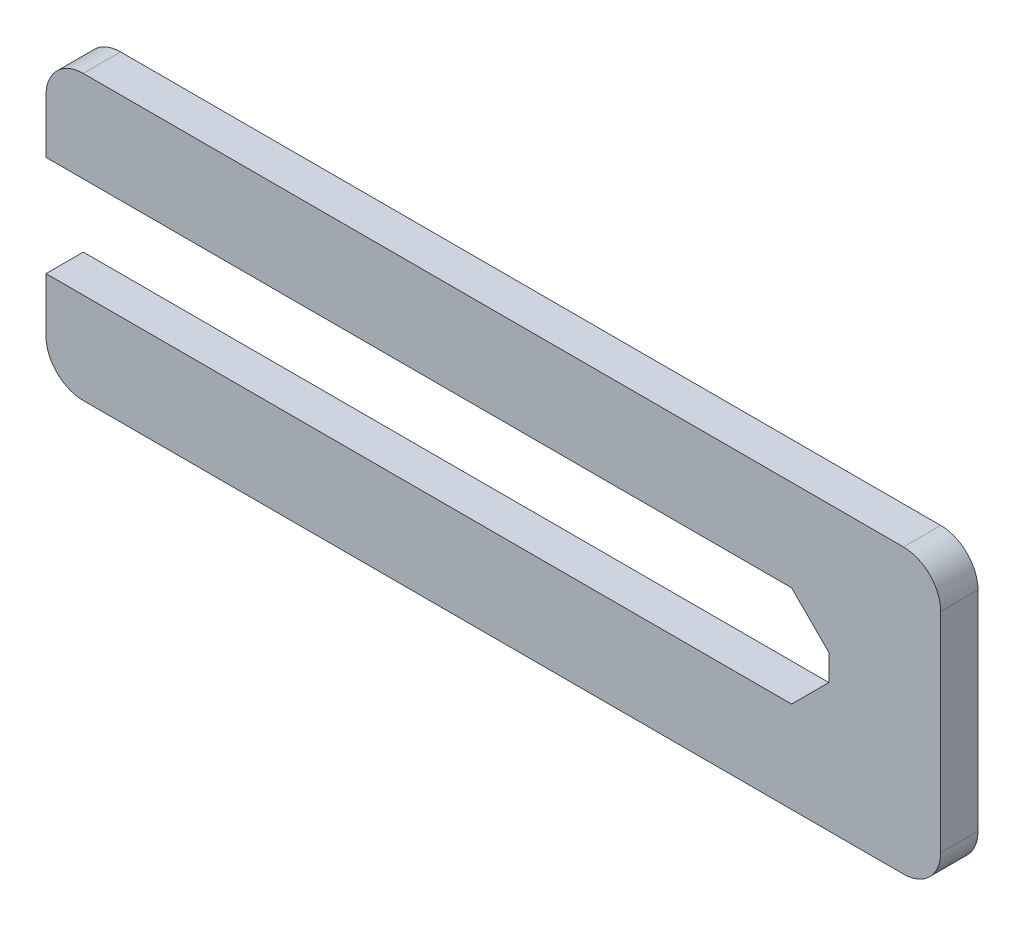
ISO-10303-21;
HEADER;
FILE_DESCRIPTION(('STEP AP214'),'2;1');
FILE_NAME('part.step','',(''),(''),'','','');
FILE_SCHEMA(('AUTOMOTIVE_DESIGN { 1 0 10303 214 1 1 1 1 }'));
ENDSEC;
DATA;
#1=APPLICATION_CONTEXT('core data for automotive mechanical design processes');
#2=APPLICATION_PROTOCOL_DEFINITION('international standard','automotive_design',2000,#1);
#3=PRODUCT_CONTEXT('',#1,'mechanical');
#4=PRODUCT('Part','Part','',(#3));
#5=PRODUCT_RELATED_PRODUCT_CATEGORY('part','',(#4));
#6=PRODUCT_DEFINITION_FORMATION('','',#4);
#7=PRODUCT_DEFINITION_CONTEXT('part definition',#1,'design');
#8=PRODUCT_DEFINITION('design','',#6,#7);
#9=PRODUCT_DEFINITION_SHAPE('','',#8);
#10=(LENGTH_UNIT() NAMED_UNIT(*) SI_UNIT(.MILLI.,.METRE.));
#11=(NAMED_UNIT(*) PLANE_ANGLE_UNIT() SI_UNIT($,.RADIAN.));
#12=(NAMED_UNIT(*) SI_UNIT($,.STERADIAN.) SOLID_ANGLE_UNIT());
#13=UNCERTAINTY_MEASURE_WITH_UNIT(LENGTH_MEASURE(1.E-05),#10,'distance_accuracy_value','');
#14=(GEOMETRIC_REPRESENTATION_CONTEXT(3) GLOBAL_UNCERTAINTY_ASSIGNED_CONTEXT((#13)) GLOBAL_UNIT_ASSIGNED_CONTEXT((#10,
#11,#12)) REPRESENTATION_CONTEXT('',''));
#15=CARTESIAN_POINT('',(0.,0.,0.));
#16=DIRECTION('',(0.,0.,1.));
#17=DIRECTION('',(1.,0.,0.));
#18=AXIS2_PLACEMENT_3D('',#15,#16,#17);
#19=CARTESIAN_POINT('',(0.,0.,5.));
#20=DIRECTION('',(1.,0.,0.));
#21=DIRECTION('',(0.,0.,-1.));
#22=AXIS2_PLACEMENT_3D('',#19,#20,#21);
#23=PLANE('',#22);
#24=DIRECTION('',(0.,-1.,0.));
#25=VECTOR('',#24,1.);
#26=CARTESIAN_POINT('',(0.,0.,5.));
#27=LINE('',#26,#25);
#28=CARTESIAN_POINT('',(0.,33.,5.));
#29=VERTEX_POINT('',#28);
#30=CARTESIAN_POINT('',(0.,25.75,5.));
#31=VERTEX_POINT('',#30);
#32=EDGE_CURVE('E159',#29,#31,#27,.T.);
#33=ORIENTED_EDGE('',*,*,#32,.F.);
#34=DIRECTION('',(0.,0.,-1.));
#35=VECTOR('',#34,1.);
#36=CARTESIAN_POINT('',(0.,33.,5.));
#37=LINE('',#36,#35);
#38=CARTESIAN_POINT('',(0.,33.,0.));
#39=VERTEX_POINT('',#38);
#40=EDGE_CURVE('E230',#29,#39,#37,.T.);
#41=ORIENTED_EDGE('',*,*,#40,.T.);
#42=DIRECTION('',(0.,-1.,0.));
#43=VECTOR('',#42,1.);
#44=CARTESIAN_POINT('',(0.,0.,0.));
#45=LINE('',#44,#43);
#46=CARTESIAN_POINT('',(0.,25.75,0.));
#47=VERTEX_POINT('',#46);
#48=EDGE_CURVE('E172',#39,#47,#45,.T.);
#49=ORIENTED_EDGE('',*,*,#48,.T.);
#50=DIRECTION('',(0.,0.,1.));
#51=VECTOR('',#50,1.);
#52=CARTESIAN_POINT('',(0.,25.75,-1.));
#53=LINE('',#52,#51);
#54=EDGE_CURVE('E144',#47,#31,#53,.T.);
#55=ORIENTED_EDGE('',*,*,#54,.T.);
#56=EDGE_LOOP('',(#33,#41,#49,#55));
#57=FACE_BOUND('',#56,.T.);
#58=ADVANCED_FACE('F32',(#57),#23,.F.);
#59=CARTESIAN_POINT('',(0.,12.25,0.));
#60=VERTEX_POINT('',#59);
#61=CARTESIAN_POINT('',(0.,5.,0.));
#62=VERTEX_POINT('',#61);
#63=EDGE_CURVE('E175',#60,#62,#45,.T.);
#64=ORIENTED_EDGE('',*,*,#63,.T.);
#65=DIRECTION('',(0.,0.,-1.));
#66=VECTOR('',#65,1.);
#67=CARTESIAN_POINT('',(0.,5.,5.));
#68=LINE('',#67,#66);
#69=CARTESIAN_POINT('',(0.,5.,5.));
#70=VERTEX_POINT('',#69);
#71=EDGE_CURVE('E158',#62,#70,#68,.F.);
#72=ORIENTED_EDGE('',*,*,#71,.T.);
#73=CARTESIAN_POINT('',(0.,12.25,5.));
#74=VERTEX_POINT('',#73);
#75=EDGE_CURVE('E150',#74,#70,#27,.T.);
#76=ORIENTED_EDGE('',*,*,#75,.F.);
#77=DIRECTION('',(0.,0.,1.));
#78=VECTOR('',#77,1.);
#79=CARTESIAN_POINT('',(0.,12.25,-1.));
#80=LINE('',#79,#78);
#81=EDGE_CURVE('E133',#60,#74,#80,.T.);
#82=ORIENTED_EDGE('',*,*,#81,.F.);
#83=EDGE_LOOP('',(#64,#72,#76,#82));
#84=FACE_BOUND('',#83,.T.);
#85=ADVANCED_FACE('F156',(#84),#23,.F.);
#86=CARTESIAN_POINT('',(0.,0.,5.));
#87=DIRECTION('',(0.,1.,0.));
#88=DIRECTION('',(0.,0.,1.));
#89=AXIS2_PLACEMENT_3D('',#86,#87,#88);
#90=PLANE('',#89);
#91=DIRECTION('',(1.,0.,0.));
#92=VECTOR('',#91,1.);
#93=CARTESIAN_POINT('',(0.,0.,0.));
#94=LINE('',#93,#92);
#95=CARTESIAN_POINT('',(5.,0.,0.));
#96=VERTEX_POINT('',#95);
#97=CARTESIAN_POINT('',(115.,0.,0.));
#98=VERTEX_POINT('',#97);
#99=EDGE_CURVE('E174',#96,#98,#94,.T.);
#100=ORIENTED_EDGE('',*,*,#99,.T.);
#101=DIRECTION('',(0.,0.,-1.));
#102=VECTOR('',#101,1.);
#103=CARTESIAN_POINT('',(115.,0.,5.));
#104=LINE('',#103,#102);
#105=CARTESIAN_POINT('',(115.,0.,5.));
#106=VERTEX_POINT('',#105);
#107=EDGE_CURVE('E220',#98,#106,#104,.F.);
#108=ORIENTED_EDGE('',*,*,#107,.T.);
#109=DIRECTION('',(1.,0.,0.));
#110=VECTOR('',#109,1.);
#111=CARTESIAN_POINT('',(0.,0.,5.));
#112=LINE('',#111,#110);
#113=CARTESIAN_POINT('',(5.,0.,5.));
#114=VERTEX_POINT('',#113);
#115=EDGE_CURVE('E162',#114,#106,#112,.T.);
#116=ORIENTED_EDGE('',*,*,#115,.F.);
#117=DIRECTION('',(0.,0.,-1.));
#118=VECTOR('',#117,1.);
#119=CARTESIAN_POINT('',(5.,0.,5.));
#120=LINE('',#119,#118);
#121=EDGE_CURVE('E217',#114,#96,#120,.T.);
#122=ORIENTED_EDGE('',*,*,#121,.T.);
#123=EDGE_LOOP('',(#100,#108,#116,#122));
#124=FACE_BOUND('',#123,.T.);
#125=ADVANCED_FACE('F264',(#124),#90,.F.);
#126=CARTESIAN_POINT('',(120.,0.,5.));
#127=DIRECTION('',(-1.,0.,0.));
#128=DIRECTION('',(0.,0.,1.));
#129=AXIS2_PLACEMENT_3D('',#126,#127,#128);
#130=PLANE('',#129);
#131=DIRECTION('',(0.,1.,0.));
#132=VECTOR('',#131,1.);
#133=CARTESIAN_POINT('',(120.,0.,5.));
#134=LINE('',#133,#132);
#135=CARTESIAN_POINT('',(120.,5.,5.));
#136=VERTEX_POINT('',#135);
#137=CARTESIAN_POINT('',(120.,33.,5.));
#138=VERTEX_POINT('',#137);
#139=EDGE_CURVE('E168',#136,#138,#134,.T.);
#140=ORIENTED_EDGE('',*,*,#139,.F.);
#141=DIRECTION('',(0.,0.,-1.));
#142=VECTOR('',#141,1.);
#143=CARTESIAN_POINT('',(120.,5.,5.));
#144=LINE('',#143,#142);
#145=CARTESIAN_POINT('',(120.,5.,0.));
#146=VERTEX_POINT('',#145);
#147=EDGE_CURVE('E206',#136,#146,#144,.T.);
#148=ORIENTED_EDGE('',*,*,#147,.T.);
#149=DIRECTION('',(0.,1.,0.));
#150=VECTOR('',#149,1.);
#151=CARTESIAN_POINT('',(120.,0.,0.));
#152=LINE('',#151,#150);
#153=CARTESIAN_POINT('',(120.,33.,0.));
#154=VERTEX_POINT('',#153);
#155=EDGE_CURVE('E163',#146,#154,#152,.T.);
#156=ORIENTED_EDGE('',*,*,#155,.T.);
#157=DIRECTION('',(0.,0.,-1.));
#158=VECTOR('',#157,1.);
#159=CARTESIAN_POINT('',(120.,33.,5.));
#160=LINE('',#159,#158);
#161=EDGE_CURVE('E204',#154,#138,#160,.F.);
#162=ORIENTED_EDGE('',*,*,#161,.T.);
#163=EDGE_LOOP('',(#140,#148,#156,#162));
#164=FACE_BOUND('',#163,.T.);
#165=ADVANCED_FACE('F272',(#164),#130,.F.);
#166=CARTESIAN_POINT('',(0.,38.,5.));
#167=DIRECTION('',(0.,-1.,0.));
#168=DIRECTION('',(0.,0.,-1.));
#169=AXIS2_PLACEMENT_3D('',#166,#167,#168);
#170=PLANE('',#169);
#171=DIRECTION('',(-1.,0.,0.));
#172=VECTOR('',#171,1.);
#173=CARTESIAN_POINT('',(0.,38.,0.));
#174=LINE('',#173,#172);
#175=CARTESIAN_POINT('',(115.,38.,0.));
#176=VERTEX_POINT('',#175);
#177=CARTESIAN_POINT('',(5.,38.,0.));
#178=VERTEX_POINT('',#177);
#179=EDGE_CURVE('E160',#176,#178,#174,.T.);
#180=ORIENTED_EDGE('',*,*,#179,.T.);
#181=DIRECTION('',(0.,0.,-1.));
#182=VECTOR('',#181,1.);
#183=CARTESIAN_POINT('',(5.,38.,5.));
#184=LINE('',#183,#182);
#185=CARTESIAN_POINT('',(5.,38.,5.));
#186=VERTEX_POINT('',#185);
#187=EDGE_CURVE('E11',#178,#186,#184,.F.);
#188=ORIENTED_EDGE('',*,*,#187,.T.);
#189=DIRECTION('',(-1.,0.,0.));
#190=VECTOR('',#189,1.);
#191=CARTESIAN_POINT('',(0.,38.,5.));
#192=LINE('',#191,#190);
#193=CARTESIAN_POINT('',(115.,38.,5.));
#194=VERTEX_POINT('',#193);
#195=EDGE_CURVE('E170',#194,#186,#192,.T.);
#196=ORIENTED_EDGE('',*,*,#195,.F.);
#197=DIRECTION('',(0.,0.,-1.));
#198=VECTOR('',#197,1.);
#199=CARTESIAN_POINT('',(115.,38.,5.));
#200=LINE('',#199,#198);
#201=EDGE_CURVE('E40',#194,#176,#200,.T.);
#202=ORIENTED_EDGE('',*,*,#201,.T.);
#203=EDGE_LOOP('',(#180,#188,#196,#202));
#204=FACE_BOUND('',#203,.T.);
#205=ADVANCED_FACE('F235',(#204),#170,.F.);
#206=CARTESIAN_POINT('',(0.,38.,5.));
#207=DIRECTION('',(0.,0.,-1.));
#208=DIRECTION('',(-1.,0.,0.));
#209=AXIS2_PLACEMENT_3D('',#206,#207,#208);
#210=PLANE('',#209);
#211=ORIENTED_EDGE('',*,*,#115,.T.);
#212=CARTESIAN_POINT('',(115.,5.,5.));
#213=DIRECTION('',(0.,0.,-1.));
#214=DIRECTION('',(-1.,0.,0.));
#215=AXIS2_PLACEMENT_3D('',#212,#213,#214);
#216=CIRCLE('',#215,5.);
#217=EDGE_CURVE('E227',#106,#136,#216,.F.);
#218=ORIENTED_EDGE('',*,*,#217,.T.);
#219=ORIENTED_EDGE('',*,*,#139,.T.);
#220=CARTESIAN_POINT('',(115.,33.,5.));
#221=DIRECTION('',(0.,0.,-1.));
#222=DIRECTION('',(-1.,0.,0.));
#223=AXIS2_PLACEMENT_3D('',#220,#221,#222);
#224=CIRCLE('',#223,5.);
#225=EDGE_CURVE('E52',#138,#194,#224,.F.);
#226=ORIENTED_EDGE('',*,*,#225,.T.);
#227=ORIENTED_EDGE('',*,*,#195,.T.);
#228=CARTESIAN_POINT('',(5.,33.,5.));
#229=DIRECTION('',(0.,0.,-1.));
#230=DIRECTION('',(-1.,0.,0.));
#231=AXIS2_PLACEMENT_3D('',#228,#229,#230);
#232=CIRCLE('',#231,5.);
#233=EDGE_CURVE('E223',#186,#29,#232,.F.);
#234=ORIENTED_EDGE('',*,*,#233,.T.);
#235=ORIENTED_EDGE('',*,*,#32,.T.);
#236=DIRECTION('',(-1.,0.,0.));
#237=VECTOR('',#236,1.);
#238=CARTESIAN_POINT('',(0.,25.75,5.));
#239=LINE('',#238,#237);
#240=CARTESIAN_POINT('',(100.,25.75,5.));
#241=VERTEX_POINT('',#240);
#242=EDGE_CURVE('E145',#241,#31,#239,.T.);
#243=ORIENTED_EDGE('',*,*,#242,.F.);
#244=DIRECTION('',(-0.707106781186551,0.707106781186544,0.));
#245=VECTOR('',#244,1.);
#246=CARTESIAN_POINT('',(43.8749999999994,81.8749999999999,5.));
#247=LINE('',#246,#245);
#248=CARTESIAN_POINT('',(105.,20.75,5.));
#249=VERTEX_POINT('',#248);
#250=EDGE_CURVE('E197',#241,#249,#247,.F.);
#251=ORIENTED_EDGE('',*,*,#250,.T.);
#252=DIRECTION('',(0.,1.,0.));
#253=VECTOR('',#252,1.);
#254=CARTESIAN_POINT('',(105.,25.75,5.));
#255=LINE('',#254,#253);
#256=CARTESIAN_POINT('',(105.,17.25,5.));
#257=VERTEX_POINT('',#256);
#258=EDGE_CURVE('E154',#257,#249,#255,.T.);
#259=ORIENTED_EDGE('',*,*,#258,.F.);
#260=DIRECTION('',(0.707106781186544,0.707106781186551,0.));
#261=VECTOR('',#260,1.);
#262=CARTESIAN_POINT('',(62.8750000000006,-24.8749999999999,5.));
#263=LINE('',#262,#261);
#264=CARTESIAN_POINT('',(100.,12.25,5.));
#265=VERTEX_POINT('',#264);
#266=EDGE_CURVE('E153',#257,#265,#263,.F.);
#267=ORIENTED_EDGE('',*,*,#266,.T.);
#268=DIRECTION('',(1.,0.,0.));
#269=VECTOR('',#268,1.);
#270=CARTESIAN_POINT('',(0.,12.25,5.));
#271=LINE('',#270,#269);
#272=EDGE_CURVE('E136',#74,#265,#271,.T.);
#273=ORIENTED_EDGE('',*,*,#272,.F.);
#274=ORIENTED_EDGE('',*,*,#75,.T.);
#275=CARTESIAN_POINT('',(5.,5.,5.));
#276=DIRECTION('',(0.,0.,-1.));
#277=DIRECTION('',(-1.,0.,0.));
#278=AXIS2_PLACEMENT_3D('',#275,#276,#277);
#279=CIRCLE('',#278,5.);
#280=EDGE_CURVE('E225',#70,#114,#279,.F.);
#281=ORIENTED_EDGE('',*,*,#280,.T.);
#282=EDGE_LOOP('',(#211,#218,#219,#226,#227,#234,#235,#243,#251,#259,#267,#273,#274,#281));
#283=FACE_BOUND('',#282,.T.);
#284=ADVANCED_FACE('F149',(#283),#210,.F.);
#285=CARTESIAN_POINT('',(0.,38.,0.));
#286=DIRECTION('',(0.,0.,-1.));
#287=DIRECTION('',(-1.,0.,0.));
#288=AXIS2_PLACEMENT_3D('',#285,#286,#287);
#289=PLANE('',#288);
#290=ORIENTED_EDGE('',*,*,#155,.F.);
#291=CARTESIAN_POINT('',(115.,5.,0.));
#292=DIRECTION('',(0.,0.,-1.));
#293=DIRECTION('',(-1.,0.,0.));
#294=AXIS2_PLACEMENT_3D('',#291,#292,#293);
#295=CIRCLE('',#294,5.);
#296=EDGE_CURVE('E215',#146,#98,#295,.T.);
#297=ORIENTED_EDGE('',*,*,#296,.T.);
#298=ORIENTED_EDGE('',*,*,#99,.F.);
#299=CARTESIAN_POINT('',(5.,5.,0.));
#300=DIRECTION('',(0.,0.,-1.));
#301=DIRECTION('',(-1.,0.,0.));
#302=AXIS2_PLACEMENT_3D('',#299,#300,#301);
#303=CIRCLE('',#302,5.);
#304=EDGE_CURVE('E213',#96,#62,#303,.T.);
#305=ORIENTED_EDGE('',*,*,#304,.T.);
#306=ORIENTED_EDGE('',*,*,#63,.F.);
#307=DIRECTION('',(-1.,0.,0.));
#308=VECTOR('',#307,1.);
#309=CARTESIAN_POINT('',(0.,12.25,0.));
#310=LINE('',#309,#308);
#311=CARTESIAN_POINT('',(100.,12.25,0.));
#312=VERTEX_POINT('',#311);
#313=EDGE_CURVE('E139',#312,#60,#310,.T.);
#314=ORIENTED_EDGE('',*,*,#313,.F.);
#315=DIRECTION('',(-0.707106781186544,-0.707106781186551,0.));
#316=VECTOR('',#315,1.);
#317=CARTESIAN_POINT('',(105.,17.25,0.));
#318=LINE('',#317,#316);
#319=CARTESIAN_POINT('',(105.,17.25,0.));
#320=VERTEX_POINT('',#319);
#321=EDGE_CURVE('E202',#312,#320,#318,.F.);
#322=ORIENTED_EDGE('',*,*,#321,.T.);
#323=DIRECTION('',(0.,-1.,0.));
#324=VECTOR('',#323,1.);
#325=CARTESIAN_POINT('',(105.,38.,0.));
#326=LINE('',#325,#324);
#327=CARTESIAN_POINT('',(105.,20.75,0.));
#328=VERTEX_POINT('',#327);
#329=EDGE_CURVE('E181',#328,#320,#326,.T.);
#330=ORIENTED_EDGE('',*,*,#329,.F.);
#331=DIRECTION('',(0.707106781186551,-0.707106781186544,0.));
#332=VECTOR('',#331,1.);
#333=CARTESIAN_POINT('',(100.,25.75,0.));
#334=LINE('',#333,#332);
#335=CARTESIAN_POINT('',(100.,25.75,0.));
#336=VERTEX_POINT('',#335);
#337=EDGE_CURVE('E199',#328,#336,#334,.F.);
#338=ORIENTED_EDGE('',*,*,#337,.T.);
#339=DIRECTION('',(1.,0.,0.));
#340=VECTOR('',#339,1.);
#341=CARTESIAN_POINT('',(0.,25.75,0.));
#342=LINE('',#341,#340);
#343=EDGE_CURVE('E184',#47,#336,#342,.T.);
#344=ORIENTED_EDGE('',*,*,#343,.F.);
#345=ORIENTED_EDGE('',*,*,#48,.F.);
#346=CARTESIAN_POINT('',(5.,33.,0.));
#347=DIRECTION('',(0.,0.,-1.));
#348=DIRECTION('',(-1.,0.,0.));
#349=AXIS2_PLACEMENT_3D('',#346,#347,#348);
#350=CIRCLE('',#349,5.);
#351=EDGE_CURVE('E211',#39,#178,#350,.T.);
#352=ORIENTED_EDGE('',*,*,#351,.T.);
#353=ORIENTED_EDGE('',*,*,#179,.F.);
#354=CARTESIAN_POINT('',(115.,33.,0.));
#355=DIRECTION('',(0.,0.,-1.));
#356=DIRECTION('',(-1.,0.,0.));
#357=AXIS2_PLACEMENT_3D('',#354,#355,#356);
#358=CIRCLE('',#357,5.);
#359=EDGE_CURVE('E209',#176,#154,#358,.T.);
#360=ORIENTED_EDGE('',*,*,#359,.T.);
#361=EDGE_LOOP('',(#290,#297,#298,#305,#306,#314,#322,#330,#338,#344,#345,#352,#353,#360));
#362=FACE_BOUND('',#361,.T.);
#363=ADVANCED_FACE('F239',(#362),#289,.T.);
#364=CARTESIAN_POINT('',(0.,25.75,-1.));
#365=DIRECTION('',(0.,1.,0.));
#366=DIRECTION('',(0.,0.,1.));
#367=AXIS2_PLACEMENT_3D('',#364,#365,#366);
#368=PLANE('',#367);
#369=ORIENTED_EDGE('',*,*,#343,.T.);
#370=DIRECTION('',(0.,0.,1.));
#371=VECTOR('',#370,1.);
#372=CARTESIAN_POINT('',(100.,25.75,5.));
#373=LINE('',#372,#371);
#374=EDGE_CURVE('E187',#336,#241,#373,.T.);
#375=ORIENTED_EDGE('',*,*,#374,.T.);
#376=ORIENTED_EDGE('',*,*,#242,.T.);
#377=ORIENTED_EDGE('',*,*,#54,.F.);
#378=EDGE_LOOP('',(#369,#375,#376,#377));
#379=FACE_BOUND('',#378,.T.);
#380=ADVANCED_FACE('F253',(#379),#368,.F.);
#381=CARTESIAN_POINT('',(105.,25.75,-1.));
#382=DIRECTION('',(1.,0.,0.));
#383=DIRECTION('',(0.,0.,-1.));
#384=AXIS2_PLACEMENT_3D('',#381,#382,#383);
#385=PLANE('',#384);
#386=ORIENTED_EDGE('',*,*,#258,.T.);
#387=DIRECTION('',(0.,0.,-1.));
#388=VECTOR('',#387,1.);
#389=CARTESIAN_POINT('',(105.,20.75,0.));
#390=LINE('',#389,#388);
#391=EDGE_CURVE('E193',#249,#328,#390,.T.);
#392=ORIENTED_EDGE('',*,*,#391,.T.);
#393=ORIENTED_EDGE('',*,*,#329,.T.);
#394=DIRECTION('',(0.,0.,1.));
#395=VECTOR('',#394,1.);
#396=CARTESIAN_POINT('',(105.,17.25,5.));
#397=LINE('',#396,#395);
#398=EDGE_CURVE('E190',#320,#257,#397,.T.);
#399=ORIENTED_EDGE('',*,*,#398,.T.);
#400=EDGE_LOOP('',(#386,#392,#393,#399));
#401=FACE_BOUND('',#400,.T.);
#402=ADVANCED_FACE('F336',(#401),#385,.F.);
#403=CARTESIAN_POINT('',(0.,12.25,-1.));
#404=DIRECTION('',(0.,-1.,0.));
#405=DIRECTION('',(0.,0.,-1.));
#406=AXIS2_PLACEMENT_3D('',#403,#404,#405);
#407=PLANE('',#406);
#408=ORIENTED_EDGE('',*,*,#272,.T.);
#409=DIRECTION('',(0.,0.,-1.));
#410=VECTOR('',#409,1.);
#411=CARTESIAN_POINT('',(100.,12.25,0.));
#412=LINE('',#411,#410);
#413=EDGE_CURVE('E195',#265,#312,#412,.T.);
#414=ORIENTED_EDGE('',*,*,#413,.T.);
#415=ORIENTED_EDGE('',*,*,#313,.T.);
#416=ORIENTED_EDGE('',*,*,#81,.T.);
#417=EDGE_LOOP('',(#408,#414,#415,#416));
#418=FACE_BOUND('',#417,.T.);
#419=ADVANCED_FACE('F135',(#418),#407,.F.);
#420=CARTESIAN_POINT('',(100.,25.75,-1.));
#421=DIRECTION('',(-0.707106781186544,-0.707106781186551,0.));
#422=DIRECTION('',(0.707106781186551,-0.707106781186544,0.));
#423=AXIS2_PLACEMENT_3D('',#420,#421,#422);
#424=PLANE('',#423);
#425=ORIENTED_EDGE('',*,*,#337,.F.);
#426=ORIENTED_EDGE('',*,*,#391,.F.);
#427=ORIENTED_EDGE('',*,*,#250,.F.);
#428=ORIENTED_EDGE('',*,*,#374,.F.);
#429=EDGE_LOOP('',(#425,#426,#427,#428));
#430=FACE_BOUND('',#429,.T.);
#431=ADVANCED_FACE('F286',(#430),#424,.T.);
#432=CARTESIAN_POINT('',(105.,17.25,-1.));
#433=DIRECTION('',(-0.707106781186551,0.707106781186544,0.));
#434=DIRECTION('',(-0.707106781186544,-0.707106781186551,0.));
#435=AXIS2_PLACEMENT_3D('',#432,#433,#434);
#436=PLANE('',#435);
#437=ORIENTED_EDGE('',*,*,#321,.F.);
#438=ORIENTED_EDGE('',*,*,#413,.F.);
#439=ORIENTED_EDGE('',*,*,#266,.F.);
#440=ORIENTED_EDGE('',*,*,#398,.F.);
#441=EDGE_LOOP('',(#437,#438,#439,#440));
#442=FACE_BOUND('',#441,.T.);
#443=ADVANCED_FACE('F289',(#442),#436,.T.);
#444=CARTESIAN_POINT('',(115.,5.,5.));
#445=DIRECTION('',(0.,0.,-1.));
#446=DIRECTION('',(-1.,0.,0.));
#447=AXIS2_PLACEMENT_3D('',#444,#445,#446);
#448=CYLINDRICAL_SURFACE('',#447,5.);
#449=ORIENTED_EDGE('',*,*,#217,.F.);
#450=ORIENTED_EDGE('',*,*,#107,.F.);
#451=ORIENTED_EDGE('',*,*,#296,.F.);
#452=ORIENTED_EDGE('',*,*,#147,.F.);
#453=EDGE_LOOP('',(#449,#450,#451,#452));
#454=FACE_BOUND('',#453,.T.);
#455=ADVANCED_FACE('F268',(#454),#448,.T.);
#456=CARTESIAN_POINT('',(5.,5.,5.));
#457=DIRECTION('',(0.,0.,-1.));
#458=DIRECTION('',(-1.,0.,0.));
#459=AXIS2_PLACEMENT_3D('',#456,#457,#458);
#460=CYLINDRICAL_SURFACE('',#459,5.);
#461=ORIENTED_EDGE('',*,*,#280,.F.);
#462=ORIENTED_EDGE('',*,*,#71,.F.);
#463=ORIENTED_EDGE('',*,*,#304,.F.);
#464=ORIENTED_EDGE('',*,*,#121,.F.);
#465=EDGE_LOOP('',(#461,#462,#463,#464));
#466=FACE_BOUND('',#465,.T.);
#467=ADVANCED_FACE('F259',(#466),#460,.T.);
#468=CARTESIAN_POINT('',(5.,33.,5.));
#469=DIRECTION('',(0.,0.,-1.));
#470=DIRECTION('',(-1.,0.,0.));
#471=AXIS2_PLACEMENT_3D('',#468,#469,#470);
#472=CYLINDRICAL_SURFACE('',#471,5.);
#473=ORIENTED_EDGE('',*,*,#233,.F.);
#474=ORIENTED_EDGE('',*,*,#187,.F.);
#475=ORIENTED_EDGE('',*,*,#351,.F.);
#476=ORIENTED_EDGE('',*,*,#40,.F.);
#477=EDGE_LOOP('',(#473,#474,#475,#476));
#478=FACE_BOUND('',#477,.T.);
#479=ADVANCED_FACE('F245',(#478),#472,.T.);
#480=CARTESIAN_POINT('',(115.,33.,5.));
#481=DIRECTION('',(0.,0.,-1.));
#482=DIRECTION('',(-1.,0.,0.));
#483=AXIS2_PLACEMENT_3D('',#480,#481,#482);
#484=CYLINDRICAL_SURFACE('',#483,5.);
#485=ORIENTED_EDGE('',*,*,#225,.F.);
#486=ORIENTED_EDGE('',*,*,#161,.F.);
#487=ORIENTED_EDGE('',*,*,#359,.F.);
#488=ORIENTED_EDGE('',*,*,#201,.F.);
#489=EDGE_LOOP('',(#485,#486,#487,#488));
#490=FACE_BOUND('',#489,.T.);
#491=ADVANCED_FACE('F34',(#490),#484,.T.);
#492=CLOSED_SHELL('',(#58,#85,#125,#165,#205,#284,#363,#380,#402,#419,#431,#443,#455,#467,#479,#491));
#493=MANIFOLD_SOLID_BREP('B2',#492);
#494=ADVANCED_BREP_SHAPE_REPRESENTATION('',(#18,#493),#14);
#495=SHAPE_DEFINITION_REPRESENTATION(#9,#494);
ENDSEC;
END-ISO-10303-21;
